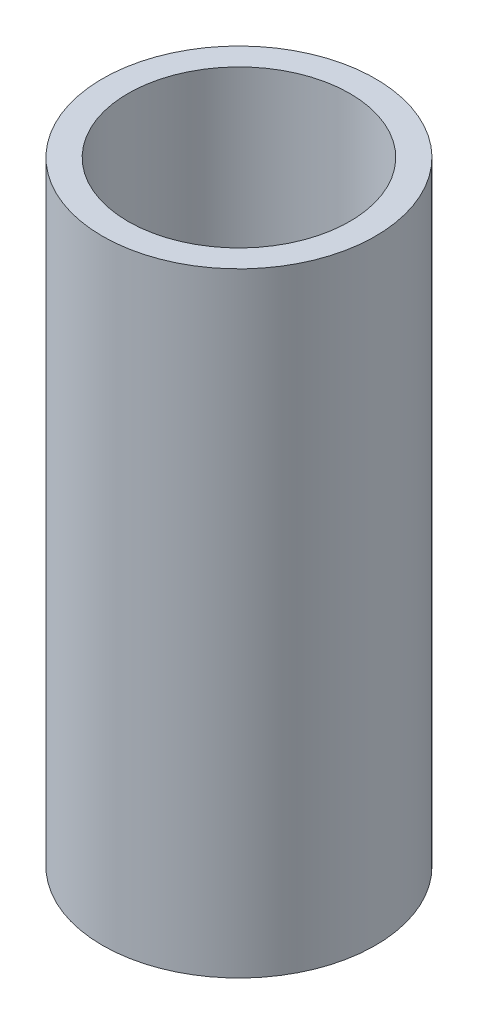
ISO-10303-21;
HEADER;
FILE_DESCRIPTION(('STEP AP214'),'2;1');
FILE_NAME('part.step','',(''),(''),'','','');
FILE_SCHEMA(('AUTOMOTIVE_DESIGN { 1 0 10303 214 1 1 1 1 }'));
ENDSEC;
DATA;
#1=APPLICATION_CONTEXT('core data for automotive mechanical design processes');
#2=APPLICATION_PROTOCOL_DEFINITION('international standard','automotive_design',2000,#1);
#3=PRODUCT_CONTEXT('',#1,'mechanical');
#4=PRODUCT('Part','Part','',(#3));
#5=PRODUCT_RELATED_PRODUCT_CATEGORY('part','',(#4));
#6=PRODUCT_DEFINITION_FORMATION('','',#4);
#7=PRODUCT_DEFINITION_CONTEXT('part definition',#1,'design');
#8=PRODUCT_DEFINITION('design','',#6,#7);
#9=PRODUCT_DEFINITION_SHAPE('','',#8);
#10=(LENGTH_UNIT() NAMED_UNIT(*) SI_UNIT(.MILLI.,.METRE.));
#11=(NAMED_UNIT(*) PLANE_ANGLE_UNIT() SI_UNIT($,.RADIAN.));
#12=(NAMED_UNIT(*) SI_UNIT($,.STERADIAN.) SOLID_ANGLE_UNIT());
#13=UNCERTAINTY_MEASURE_WITH_UNIT(LENGTH_MEASURE(1.E-05),#10,'distance_accuracy_value','');
#14=(GEOMETRIC_REPRESENTATION_CONTEXT(3) GLOBAL_UNCERTAINTY_ASSIGNED_CONTEXT((#13)) GLOBAL_UNIT_ASSIGNED_CONTEXT((#10,
#11,#12)) REPRESENTATION_CONTEXT('',''));
#15=CARTESIAN_POINT('',(0.,0.,0.));
#16=DIRECTION('',(0.,0.,1.));
#17=DIRECTION('',(1.,0.,0.));
#18=AXIS2_PLACEMENT_3D('',#15,#16,#17);
#19=CARTESIAN_POINT('',(0.,18.,0.));
#20=DIRECTION('',(0.,1.,0.));
#21=DIRECTION('',(0.,0.,1.));
#22=AXIS2_PLACEMENT_3D('',#19,#20,#21);
#23=PLANE('',#22);
#24=CARTESIAN_POINT('',(0.,18.,0.));
#25=DIRECTION('',(0.,1.,0.));
#26=DIRECTION('',(0.,0.,1.));
#27=AXIS2_PLACEMENT_3D('',#24,#25,#26);
#28=CIRCLE('',#27,4.);
#29=CARTESIAN_POINT('',(0.,18.,4.));
#30=VERTEX_POINT('',#29);
#31=EDGE_CURVE('E10',#30,#30,#28,.T.);
#32=ORIENTED_EDGE('',*,*,#31,.T.);
#33=EDGE_LOOP('',(#32));
#34=FACE_BOUND('',#33,.T.);
#35=CARTESIAN_POINT('',(0.,18.,0.));
#36=DIRECTION('',(0.,1.,0.));
#37=DIRECTION('',(0.,0.,1.));
#38=AXIS2_PLACEMENT_3D('',#35,#36,#37);
#39=CIRCLE('',#38,3.25);
#40=CARTESIAN_POINT('',(0.,18.,3.25));
#41=VERTEX_POINT('',#40);
#42=EDGE_CURVE('E40',#41,#41,#39,.T.);
#43=ORIENTED_EDGE('',*,*,#42,.F.);
#44=EDGE_LOOP('',(#43));
#45=FACE_BOUND('',#44,.T.);
#46=ADVANCED_FACE('F29',(#34,#45),#23,.T.);
#47=CARTESIAN_POINT('',(0.,0.,0.));
#48=DIRECTION('',(0.,1.,0.));
#49=DIRECTION('',(0.,0.,1.));
#50=AXIS2_PLACEMENT_3D('',#47,#48,#49);
#51=PLANE('',#50);
#52=CARTESIAN_POINT('',(0.,0.,0.));
#53=DIRECTION('',(0.,1.,0.));
#54=DIRECTION('',(0.,0.,1.));
#55=AXIS2_PLACEMENT_3D('',#52,#53,#54);
#56=CIRCLE('',#55,4.);
#57=CARTESIAN_POINT('',(0.,0.,4.));
#58=VERTEX_POINT('',#57);
#59=EDGE_CURVE('E33',#58,#58,#56,.T.);
#60=ORIENTED_EDGE('',*,*,#59,.F.);
#61=EDGE_LOOP('',(#60));
#62=FACE_BOUND('',#61,.T.);
#63=CARTESIAN_POINT('',(0.,0.,0.));
#64=DIRECTION('',(0.,1.,0.));
#65=DIRECTION('',(0.,0.,1.));
#66=AXIS2_PLACEMENT_3D('',#63,#64,#65);
#67=CIRCLE('',#66,3.25);
#68=CARTESIAN_POINT('',(0.,0.,3.25));
#69=VERTEX_POINT('',#68);
#70=EDGE_CURVE('E42',#69,#69,#67,.T.);
#71=ORIENTED_EDGE('',*,*,#70,.T.);
#72=EDGE_LOOP('',(#71));
#73=FACE_BOUND('',#72,.T.);
#74=ADVANCED_FACE('F52',(#62,#73),#51,.F.);
#75=CARTESIAN_POINT('',(0.,18.,0.));
#76=DIRECTION('',(0.,-1.,0.));
#77=DIRECTION('',(0.,0.,-1.));
#78=AXIS2_PLACEMENT_3D('',#75,#76,#77);
#79=CYLINDRICAL_SURFACE('',#78,4.);
#80=ORIENTED_EDGE('',*,*,#31,.F.);
#81=EDGE_LOOP('',(#80));
#82=FACE_BOUND('',#81,.T.);
#83=ORIENTED_EDGE('',*,*,#59,.T.);
#84=EDGE_LOOP('',(#83));
#85=FACE_BOUND('',#84,.T.);
#86=ADVANCED_FACE('F31',(#82,#85),#79,.T.);
#87=CARTESIAN_POINT('',(0.,18.,0.));
#88=DIRECTION('',(0.,-1.,0.));
#89=DIRECTION('',(0.,0.,-1.));
#90=AXIS2_PLACEMENT_3D('',#87,#88,#89);
#91=CYLINDRICAL_SURFACE('',#90,3.25);
#92=ORIENTED_EDGE('',*,*,#42,.T.);
#93=EDGE_LOOP('',(#92));
#94=FACE_BOUND('',#93,.T.);
#95=ORIENTED_EDGE('',*,*,#70,.F.);
#96=EDGE_LOOP('',(#95));
#97=FACE_BOUND('',#96,.T.);
#98=ADVANCED_FACE('F48',(#94,#97),#91,.F.);
#99=CLOSED_SHELL('',(#46,#74,#86,#98));
#100=MANIFOLD_SOLID_BREP('B2',#99);
#101=ADVANCED_BREP_SHAPE_REPRESENTATION('',(#18,#100),#14);
#102=SHAPE_DEFINITION_REPRESENTATION(#9,#101);
ENDSEC;
END-ISO-10303-21;
